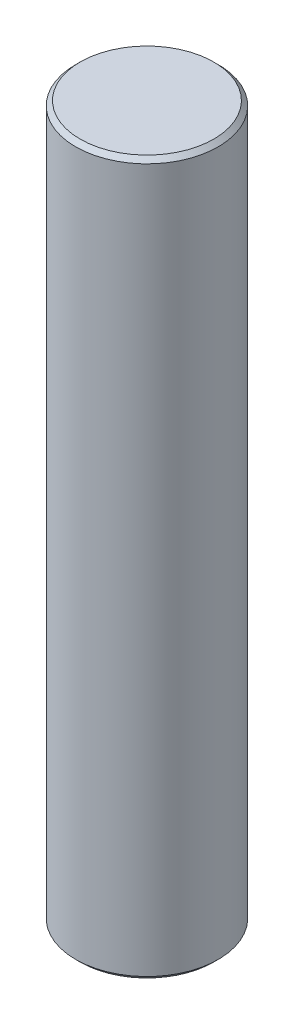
ISO-10303-21;
HEADER;
FILE_DESCRIPTION(('STEP AP214'),'2;1');
FILE_NAME('part.step','',(''),(''),'','','');
FILE_SCHEMA(('AUTOMOTIVE_DESIGN { 1 0 10303 214 1 1 1 1 }'));
ENDSEC;
DATA;
#1=APPLICATION_CONTEXT('core data for automotive mechanical design processes');
#2=APPLICATION_PROTOCOL_DEFINITION('international standard','automotive_design',2000,#1);
#3=PRODUCT_CONTEXT('',#1,'mechanical');
#4=PRODUCT('Part','Part','',(#3));
#5=PRODUCT_RELATED_PRODUCT_CATEGORY('part','',(#4));
#6=PRODUCT_DEFINITION_FORMATION('','',#4);
#7=PRODUCT_DEFINITION_CONTEXT('part definition',#1,'design');
#8=PRODUCT_DEFINITION('design','',#6,#7);
#9=PRODUCT_DEFINITION_SHAPE('','',#8);
#10=(LENGTH_UNIT() NAMED_UNIT(*) SI_UNIT(.MILLI.,.METRE.));
#11=(NAMED_UNIT(*) PLANE_ANGLE_UNIT() SI_UNIT($,.RADIAN.));
#12=(NAMED_UNIT(*) SI_UNIT($,.STERADIAN.) SOLID_ANGLE_UNIT());
#13=UNCERTAINTY_MEASURE_WITH_UNIT(LENGTH_MEASURE(1.E-05),#10,'distance_accuracy_value','');
#14=(GEOMETRIC_REPRESENTATION_CONTEXT(3) GLOBAL_UNCERTAINTY_ASSIGNED_CONTEXT((#13)) GLOBAL_UNIT_ASSIGNED_CONTEXT((#10,
#11,#12)) REPRESENTATION_CONTEXT('',''));
#15=CARTESIAN_POINT('',(0.,0.,0.));
#16=DIRECTION('',(0.,0.,1.));
#17=DIRECTION('',(1.,0.,0.));
#18=AXIS2_PLACEMENT_3D('',#15,#16,#17);
#19=CARTESIAN_POINT('',(0.,80.0000000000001,0.));
#20=DIRECTION('',(0.,-1.,0.));
#21=DIRECTION('',(0.,0.,-1.));
#22=AXIS2_PLACEMENT_3D('',#19,#20,#21);
#23=CYLINDRICAL_SURFACE('',#22,8.);
#24=CARTESIAN_POINT('',(0.,0.499999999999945,0.));
#25=DIRECTION('',(0.,1.,0.));
#26=DIRECTION('',(0.,0.,1.));
#27=AXIS2_PLACEMENT_3D('',#24,#25,#26);
#28=CIRCLE('',#27,8.);
#29=CARTESIAN_POINT('',(0.,0.499999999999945,8.00000000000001));
#30=VERTEX_POINT('',#29);
#31=EDGE_CURVE('E41',#30,#30,#28,.T.);
#32=ORIENTED_EDGE('',*,*,#31,.T.);
#33=EDGE_LOOP('',(#32));
#34=FACE_BOUND('',#33,.T.);
#35=CARTESIAN_POINT('',(0.,79.4999999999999,0.));
#36=DIRECTION('',(0.,1.,0.));
#37=DIRECTION('',(0.,0.,1.));
#38=AXIS2_PLACEMENT_3D('',#35,#36,#37);
#39=CIRCLE('',#38,8.);
#40=CARTESIAN_POINT('',(0.,79.4999999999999,8.00000000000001));
#41=VERTEX_POINT('',#40);
#42=EDGE_CURVE('E45',#41,#41,#39,.F.);
#43=ORIENTED_EDGE('',*,*,#42,.T.);
#44=EDGE_LOOP('',(#43));
#45=FACE_BOUND('',#44,.T.);
#46=ADVANCED_FACE('F30',(#34,#45),#23,.T.);
#47=CARTESIAN_POINT('',(0.,80.0000000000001,0.));
#48=DIRECTION('',(0.,1.,0.));
#49=DIRECTION('',(0.,0.,1.));
#50=AXIS2_PLACEMENT_3D('',#47,#48,#49);
#51=PLANE('',#50);
#52=CARTESIAN_POINT('',(0.,80.0000000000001,0.));
#53=DIRECTION('',(0.,1.,0.));
#54=DIRECTION('',(0.,0.,1.));
#55=AXIS2_PLACEMENT_3D('',#52,#53,#54);
#56=CIRCLE('',#55,7.50000000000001);
#57=CARTESIAN_POINT('',(0.,80.0000000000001,7.50000000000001));
#58=VERTEX_POINT('',#57);
#59=EDGE_CURVE('E10',#58,#58,#56,.T.);
#60=ORIENTED_EDGE('',*,*,#59,.T.);
#61=EDGE_LOOP('',(#60));
#62=FACE_BOUND('',#61,.T.);
#63=ADVANCED_FACE('F61',(#62),#51,.T.);
#64=CARTESIAN_POINT('',(0.,0.,0.));
#65=DIRECTION('',(0.,1.,0.));
#66=DIRECTION('',(0.,0.,1.));
#67=AXIS2_PLACEMENT_3D('',#64,#65,#66);
#68=PLANE('',#67);
#69=CARTESIAN_POINT('',(0.,0.,0.));
#70=DIRECTION('',(0.,1.,0.));
#71=DIRECTION('',(0.,0.,1.));
#72=AXIS2_PLACEMENT_3D('',#69,#70,#71);
#73=CIRCLE('',#72,7.49999999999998);
#74=CARTESIAN_POINT('',(0.,0.,7.49999999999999));
#75=VERTEX_POINT('',#74);
#76=EDGE_CURVE('E37',#75,#75,#73,.F.);
#77=ORIENTED_EDGE('',*,*,#76,.T.);
#78=EDGE_LOOP('',(#77));
#79=FACE_BOUND('',#78,.T.);
#80=ADVANCED_FACE('F58',(#79),#68,.F.);
#81=CARTESIAN_POINT('',(0.,0.499999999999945,0.));
#82=DIRECTION('',(0.,1.,0.));
#83=DIRECTION('',(0.,0.,1.));
#84=AXIS2_PLACEMENT_3D('',#81,#82,#83);
#85=CONICAL_SURFACE('',#84,8.,0.785398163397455);
#86=ORIENTED_EDGE('',*,*,#76,.F.);
#87=EDGE_LOOP('',(#86));
#88=FACE_BOUND('',#87,.T.);
#89=ORIENTED_EDGE('',*,*,#31,.F.);
#90=EDGE_LOOP('',(#89));
#91=FACE_BOUND('',#90,.T.);
#92=ADVANCED_FACE('F54',(#88,#91),#85,.T.);
#93=CARTESIAN_POINT('',(0.,80.0000000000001,0.));
#94=DIRECTION('',(0.,-1.,0.));
#95=DIRECTION('',(0.,0.,-1.));
#96=AXIS2_PLACEMENT_3D('',#93,#94,#95);
#97=CONICAL_SURFACE('',#96,7.50000000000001,0.785398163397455);
#98=ORIENTED_EDGE('',*,*,#42,.F.);
#99=EDGE_LOOP('',(#98));
#100=FACE_BOUND('',#99,.T.);
#101=ORIENTED_EDGE('',*,*,#59,.F.);
#102=EDGE_LOOP('',(#101));
#103=FACE_BOUND('',#102,.T.);
#104=ADVANCED_FACE('F32',(#100,#103),#97,.T.);
#105=CLOSED_SHELL('',(#46,#63,#80,#92,#104));
#106=MANIFOLD_SOLID_BREP('B2',#105);
#107=ADVANCED_BREP_SHAPE_REPRESENTATION('',(#18,#106),#14);
#108=SHAPE_DEFINITION_REPRESENTATION(#9,#107);
ENDSEC;
END-ISO-10303-21;
